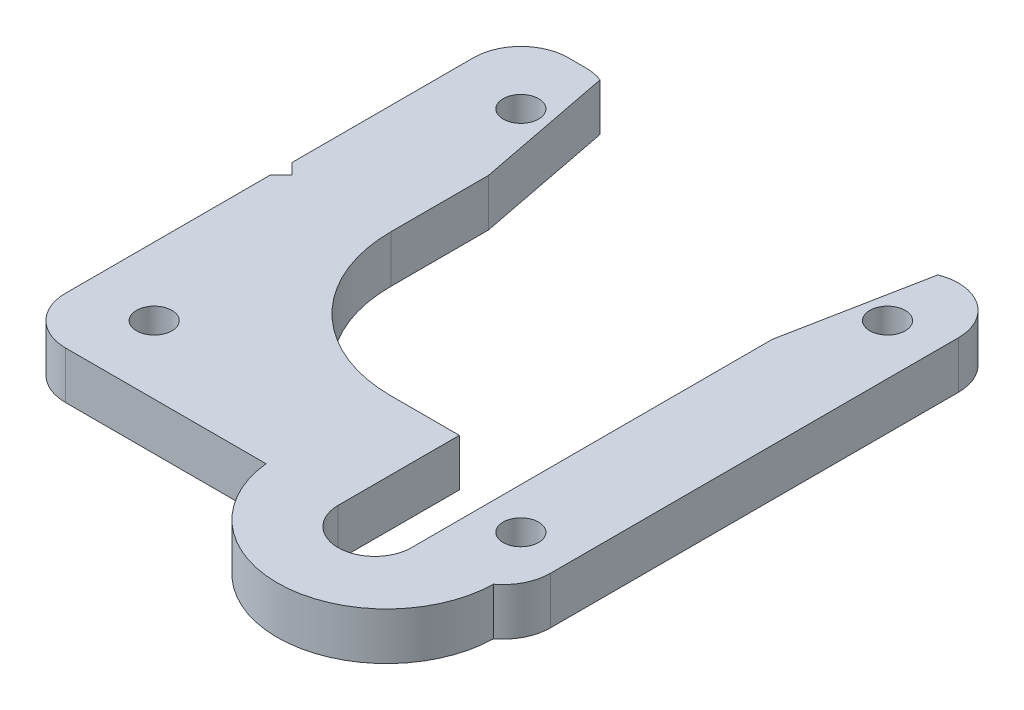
ISO-10303-21;
HEADER;
FILE_DESCRIPTION(('STEP AP214'),'2;1');
FILE_NAME('part.step','',(''),(''),'','','');
FILE_SCHEMA(('AUTOMOTIVE_DESIGN { 1 0 10303 214 1 1 1 1 }'));
ENDSEC;
DATA;
#1=APPLICATION_CONTEXT('core data for automotive mechanical design processes');
#2=APPLICATION_PROTOCOL_DEFINITION('international standard','automotive_design',2000,#1);
#3=PRODUCT_CONTEXT('',#1,'mechanical');
#4=PRODUCT('Part','Part','',(#3));
#5=PRODUCT_RELATED_PRODUCT_CATEGORY('part','',(#4));
#6=PRODUCT_DEFINITION_FORMATION('','',#4);
#7=PRODUCT_DEFINITION_CONTEXT('part definition',#1,'design');
#8=PRODUCT_DEFINITION('design','',#6,#7);
#9=PRODUCT_DEFINITION_SHAPE('','',#8);
#10=(LENGTH_UNIT() NAMED_UNIT(*) SI_UNIT(.MILLI.,.METRE.));
#11=(NAMED_UNIT(*) PLANE_ANGLE_UNIT() SI_UNIT($,.RADIAN.));
#12=(NAMED_UNIT(*) SI_UNIT($,.STERADIAN.) SOLID_ANGLE_UNIT());
#13=UNCERTAINTY_MEASURE_WITH_UNIT(LENGTH_MEASURE(1.E-05),#10,'distance_accuracy_value','');
#14=(GEOMETRIC_REPRESENTATION_CONTEXT(3) GLOBAL_UNCERTAINTY_ASSIGNED_CONTEXT((#13)) GLOBAL_UNIT_ASSIGNED_CONTEXT((#10,
#11,#12)) REPRESENTATION_CONTEXT('',''));
#15=CARTESIAN_POINT('',(0.,0.,0.));
#16=DIRECTION('',(0.,0.,1.));
#17=DIRECTION('',(1.,0.,0.));
#18=AXIS2_PLACEMENT_3D('',#15,#16,#17);
#19=CARTESIAN_POINT('',(-15.75,-2.,-20.25));
#20=DIRECTION('',(0.,0.,-1.));
#21=DIRECTION('',(-1.,0.,0.));
#22=AXIS2_PLACEMENT_3D('',#19,#20,#21);
#23=PLANE('',#22);
#24=DIRECTION('',(0.,1.,0.));
#25=VECTOR('',#24,1.);
#26=CARTESIAN_POINT('',(-15.75,-2.,-20.25));
#27=LINE('',#26,#25);
#28=CARTESIAN_POINT('',(-15.75,-2.,-20.25));
#29=VERTEX_POINT('',#28);
#30=CARTESIAN_POINT('',(-15.75,2.,-20.25));
#31=VERTEX_POINT('',#30);
#32=EDGE_CURVE('E309',#29,#31,#27,.T.);
#33=ORIENTED_EDGE('',*,*,#32,.F.);
#34=DIRECTION('',(-1.,0.,0.));
#35=VECTOR('',#34,1.);
#36=CARTESIAN_POINT('',(-15.75,-2.,-20.25));
#37=LINE('',#36,#35);
#38=CARTESIAN_POINT('',(-17.25,-2.,-20.25));
#39=VERTEX_POINT('',#38);
#40=EDGE_CURVE('E326',#29,#39,#37,.T.);
#41=ORIENTED_EDGE('',*,*,#40,.T.);
#42=DIRECTION('',(0.,1.,0.));
#43=VECTOR('',#42,1.);
#44=CARTESIAN_POINT('',(-17.25,-2.,-20.25));
#45=LINE('',#44,#43);
#46=CARTESIAN_POINT('',(-17.25,2.,-20.25));
#47=VERTEX_POINT('',#46);
#48=EDGE_CURVE('E270',#47,#39,#45,.F.);
#49=ORIENTED_EDGE('',*,*,#48,.F.);
#50=DIRECTION('',(1.,0.,0.));
#51=VECTOR('',#50,1.);
#52=CARTESIAN_POINT('',(0.,2.,-20.25));
#53=LINE('',#52,#51);
#54=EDGE_CURVE('E276',#31,#47,#53,.F.);
#55=ORIENTED_EDGE('',*,*,#54,.F.);
#56=EDGE_LOOP('',(#33,#41,#49,#55));
#57=FACE_BOUND('',#56,.T.);
#58=ADVANCED_FACE('F17',(#57),#23,.T.);
#59=CARTESIAN_POINT('',(-21.25,-2.,-0.9));
#60=DIRECTION('',(-0.707106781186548,0.,0.707106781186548));
#61=DIRECTION('',(0.707106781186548,0.,0.707106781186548));
#62=AXIS2_PLACEMENT_3D('',#59,#60,#61);
#63=PLANE('',#62);
#64=DIRECTION('',(0.,1.,0.));
#65=VECTOR('',#64,1.);
#66=CARTESIAN_POINT('',(-21.25,-2.,-0.9));
#67=LINE('',#66,#65);
#68=CARTESIAN_POINT('',(-21.25,-2.,-0.9));
#69=VERTEX_POINT('',#68);
#70=CARTESIAN_POINT('',(-21.25,2.,-0.9));
#71=VERTEX_POINT('',#70);
#72=EDGE_CURVE('E268',#69,#71,#67,.T.);
#73=ORIENTED_EDGE('',*,*,#72,.F.);
#74=DIRECTION('',(0.707106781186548,0.,0.707106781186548));
#75=VECTOR('',#74,1.);
#76=CARTESIAN_POINT('',(-21.25,-2.,-0.9));
#77=LINE('',#76,#75);
#78=CARTESIAN_POINT('',(-20.35,-2.,0.));
#79=VERTEX_POINT('',#78);
#80=EDGE_CURVE('E324',#69,#79,#77,.T.);
#81=ORIENTED_EDGE('',*,*,#80,.T.);
#82=DIRECTION('',(0.,1.,0.));
#83=VECTOR('',#82,1.);
#84=CARTESIAN_POINT('',(-20.35,-2.,0.));
#85=LINE('',#84,#83);
#86=CARTESIAN_POINT('',(-20.35,2.,0.));
#87=VERTEX_POINT('',#86);
#88=EDGE_CURVE('E310',#87,#79,#85,.F.);
#89=ORIENTED_EDGE('',*,*,#88,.F.);
#90=DIRECTION('',(0.707106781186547,0.,0.707106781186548));
#91=VECTOR('',#90,1.);
#92=CARTESIAN_POINT('',(-21.25,2.,-0.9));
#93=LINE('',#92,#91);
#94=EDGE_CURVE('E315',#71,#87,#93,.T.);
#95=ORIENTED_EDGE('',*,*,#94,.F.);
#96=EDGE_LOOP('',(#73,#81,#89,#95));
#97=FACE_BOUND('',#96,.T.);
#98=ADVANCED_FACE('F523',(#97),#63,.T.);
#99=CARTESIAN_POINT('',(-20.35,-2.,0.));
#100=DIRECTION('',(-0.707106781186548,0.,-0.707106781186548));
#101=DIRECTION('',(-0.707106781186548,0.,0.707106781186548));
#102=AXIS2_PLACEMENT_3D('',#99,#100,#101);
#103=PLANE('',#102);
#104=ORIENTED_EDGE('',*,*,#88,.T.);
#105=DIRECTION('',(-0.707106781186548,0.,0.707106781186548));
#106=VECTOR('',#105,1.);
#107=CARTESIAN_POINT('',(-20.35,-2.,0.));
#108=LINE('',#107,#106);
#109=CARTESIAN_POINT('',(-21.25,-2.,0.9));
#110=VERTEX_POINT('',#109);
#111=EDGE_CURVE('E307',#79,#110,#108,.T.);
#112=ORIENTED_EDGE('',*,*,#111,.T.);
#113=DIRECTION('',(0.,1.,0.));
#114=VECTOR('',#113,1.);
#115=CARTESIAN_POINT('',(-21.25,-2.,0.9));
#116=LINE('',#115,#114);
#117=CARTESIAN_POINT('',(-21.25,2.,0.9));
#118=VERTEX_POINT('',#117);
#119=EDGE_CURVE('E259',#118,#110,#116,.F.);
#120=ORIENTED_EDGE('',*,*,#119,.F.);
#121=DIRECTION('',(-0.707106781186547,0.,0.707106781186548));
#122=VECTOR('',#121,1.);
#123=CARTESIAN_POINT('',(-20.35,2.,0.));
#124=LINE('',#123,#122);
#125=EDGE_CURVE('E313',#87,#118,#124,.T.);
#126=ORIENTED_EDGE('',*,*,#125,.F.);
#127=EDGE_LOOP('',(#104,#112,#120,#126));
#128=FACE_BOUND('',#127,.T.);
#129=ADVANCED_FACE('F519',(#128),#103,.T.);
#130=CARTESIAN_POINT('',(-15.75,-2.,-16.25));
#131=DIRECTION('',(0.,1.,0.));
#132=DIRECTION('',(0.,0.,1.));
#133=AXIS2_PLACEMENT_3D('',#130,#131,#132);
#134=CYLINDRICAL_SURFACE('',#133,4.);
#135=DIRECTION('',(0.,1.,0.));
#136=VECTOR('',#135,1.);
#137=CARTESIAN_POINT('',(-14.2780019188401,-2.,-19.96930391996));
#138=LINE('',#137,#136);
#139=CARTESIAN_POINT('',(-14.2780019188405,-2.,-19.9693039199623));
#140=VERTEX_POINT('',#139);
#141=CARTESIAN_POINT('',(-14.2780019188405,2.,-19.9693039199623));
#142=VERTEX_POINT('',#141);
#143=EDGE_CURVE('E180',#140,#142,#138,.T.);
#144=ORIENTED_EDGE('',*,*,#143,.F.);
#145=CARTESIAN_POINT('',(-15.75,-2.,-16.25));
#146=DIRECTION('',(0.,1.,0.));
#147=DIRECTION('',(0.,0.,1.));
#148=AXIS2_PLACEMENT_3D('',#145,#146,#147);
#149=CIRCLE('',#148,4.);
#150=EDGE_CURVE('E20',#140,#29,#149,.T.);
#151=ORIENTED_EDGE('',*,*,#150,.T.);
#152=ORIENTED_EDGE('',*,*,#32,.T.);
#153=CARTESIAN_POINT('',(-15.75,2.,-16.25));
#154=DIRECTION('',(0.,1.,0.));
#155=DIRECTION('',(0.,0.,1.));
#156=AXIS2_PLACEMENT_3D('',#153,#154,#155);
#157=CIRCLE('',#156,4.);
#158=EDGE_CURVE('E277',#142,#31,#157,.T.);
#159=ORIENTED_EDGE('',*,*,#158,.F.);
#160=EDGE_LOOP('',(#144,#151,#152,#159));
#161=FACE_BOUND('',#160,.T.);
#162=ADVANCED_FACE('F673',(#161),#134,.T.);
#163=CARTESIAN_POINT('',(0.,2.,0.));
#164=DIRECTION('',(0.,1.,0.));
#165=DIRECTION('',(0.,0.,1.));
#166=AXIS2_PLACEMENT_3D('',#163,#164,#165);
#167=PLANE('',#166);
#168=CARTESIAN_POINT('',(-15.5,2.,-14.5));
#169=DIRECTION('',(0.,1.,0.));
#170=DIRECTION('',(0.,0.,1.));
#171=AXIS2_PLACEMENT_3D('',#168,#169,#170);
#172=CIRCLE('',#171,1.5);
#173=CARTESIAN_POINT('',(-15.5,2.,-13.));
#174=VERTEX_POINT('',#173);
#175=EDGE_CURVE('E380',#174,#174,#172,.F.);
#176=ORIENTED_EDGE('',*,*,#175,.T.);
#177=EDGE_LOOP('',(#176));
#178=FACE_BOUND('',#177,.T.);
#179=CARTESIAN_POINT('',(-15.5,2.,16.5));
#180=DIRECTION('',(0.,1.,0.));
#181=DIRECTION('',(0.,0.,1.));
#182=AXIS2_PLACEMENT_3D('',#179,#180,#181);
#183=CIRCLE('',#182,1.5);
#184=CARTESIAN_POINT('',(-15.5,2.,18.));
#185=VERTEX_POINT('',#184);
#186=EDGE_CURVE('E383',#185,#185,#183,.F.);
#187=ORIENTED_EDGE('',*,*,#186,.T.);
#188=EDGE_LOOP('',(#187));
#189=FACE_BOUND('',#188,.T.);
#190=CARTESIAN_POINT('',(15.5,2.,16.5));
#191=DIRECTION('',(0.,1.,0.));
#192=DIRECTION('',(0.,0.,1.));
#193=AXIS2_PLACEMENT_3D('',#190,#191,#192);
#194=CIRCLE('',#193,1.5);
#195=CARTESIAN_POINT('',(15.5,2.,18.));
#196=VERTEX_POINT('',#195);
#197=EDGE_CURVE('E201',#196,#196,#194,.F.);
#198=ORIENTED_EDGE('',*,*,#197,.T.);
#199=EDGE_LOOP('',(#198));
#200=FACE_BOUND('',#199,.T.);
#201=CARTESIAN_POINT('',(15.5,2.,-14.5));
#202=DIRECTION('',(0.,1.,0.));
#203=DIRECTION('',(0.,0.,1.));
#204=AXIS2_PLACEMENT_3D('',#201,#202,#203);
#205=CIRCLE('',#204,1.5);
#206=CARTESIAN_POINT('',(15.5,2.,-13.));
#207=VERTEX_POINT('',#206);
#208=EDGE_CURVE('E198',#207,#207,#205,.F.);
#209=ORIENTED_EDGE('',*,*,#208,.T.);
#210=EDGE_LOOP('',(#209));
#211=FACE_BOUND('',#210,.T.);
#212=ORIENTED_EDGE('',*,*,#54,.T.);
#213=CARTESIAN_POINT('',(-17.25,2.,-16.25));
#214=DIRECTION('',(0.,1.,0.));
#215=DIRECTION('',(0.,0.,1.));
#216=AXIS2_PLACEMENT_3D('',#213,#214,#215);
#217=CIRCLE('',#216,4.);
#218=CARTESIAN_POINT('',(-21.25,2.,-16.25));
#219=VERTEX_POINT('',#218);
#220=EDGE_CURVE('E275',#219,#47,#217,.F.);
#221=ORIENTED_EDGE('',*,*,#220,.F.);
#222=DIRECTION('',(0.,0.,1.));
#223=VECTOR('',#222,1.);
#224=CARTESIAN_POINT('',(-21.25,2.,-16.25));
#225=LINE('',#224,#223);
#226=EDGE_CURVE('E267',#71,#219,#225,.F.);
#227=ORIENTED_EDGE('',*,*,#226,.F.);
#228=ORIENTED_EDGE('',*,*,#94,.T.);
#229=ORIENTED_EDGE('',*,*,#125,.T.);
#230=DIRECTION('',(0.,0.,1.));
#231=VECTOR('',#230,1.);
#232=CARTESIAN_POINT('',(-21.25,2.,0.9));
#233=LINE('',#232,#231);
#234=CARTESIAN_POINT('',(-21.25,2.,18.25));
#235=VERTEX_POINT('',#234);
#236=EDGE_CURVE('E262',#235,#118,#233,.F.);
#237=ORIENTED_EDGE('',*,*,#236,.F.);
#238=CARTESIAN_POINT('',(-17.25,2.,18.25));
#239=DIRECTION('',(0.,1.,0.));
#240=DIRECTION('',(0.,0.,1.));
#241=AXIS2_PLACEMENT_3D('',#238,#239,#240);
#242=CIRCLE('',#241,4.);
#243=CARTESIAN_POINT('',(-17.25,2.,22.25));
#244=VERTEX_POINT('',#243);
#245=EDGE_CURVE('E258',#244,#235,#242,.F.);
#246=ORIENTED_EDGE('',*,*,#245,.F.);
#247=DIRECTION('',(1.,0.,0.));
#248=VECTOR('',#247,1.);
#249=CARTESIAN_POINT('',(-17.25,2.,22.25));
#250=LINE('',#249,#248);
#251=CARTESIAN_POINT('',(-0.295787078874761,2.,22.25));
#252=VERTEX_POINT('',#251);
#253=EDGE_CURVE('E254',#252,#244,#250,.F.);
#254=ORIENTED_EDGE('',*,*,#253,.F.);
#255=CARTESIAN_POINT('',(8.9,2.,21.25));
#256=DIRECTION('',(0.,1.,0.));
#257=DIRECTION('',(0.,0.,1.));
#258=AXIS2_PLACEMENT_3D('',#255,#256,#257);
#259=CIRCLE('',#258,9.25);
#260=CARTESIAN_POINT('',(18.1478018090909,2.,21.451647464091));
#261=VERTEX_POINT('',#260);
#262=EDGE_CURVE('E250',#261,#252,#259,.F.);
#263=ORIENTED_EDGE('',*,*,#262,.F.);
#264=CARTESIAN_POINT('',(15.75,2.,18.25));
#265=DIRECTION('',(0.,1.,0.));
#266=DIRECTION('',(0.,0.,1.));
#267=AXIS2_PLACEMENT_3D('',#264,#265,#266);
#268=CIRCLE('',#267,4.);
#269=CARTESIAN_POINT('',(19.75,2.,18.25));
#270=VERTEX_POINT('',#269);
#271=EDGE_CURVE('E246',#270,#261,#268,.F.);
#272=ORIENTED_EDGE('',*,*,#271,.F.);
#273=DIRECTION('',(0.,0.,-1.));
#274=VECTOR('',#273,1.);
#275=CARTESIAN_POINT('',(19.75,2.,18.25));
#276=LINE('',#275,#274);
#277=CARTESIAN_POINT('',(19.75,2.,-16.25));
#278=VERTEX_POINT('',#277);
#279=EDGE_CURVE('E242',#278,#270,#276,.F.);
#280=ORIENTED_EDGE('',*,*,#279,.F.);
#281=CARTESIAN_POINT('',(15.75,2.,-16.25));
#282=DIRECTION('',(0.,1.,0.));
#283=DIRECTION('',(0.,0.,1.));
#284=AXIS2_PLACEMENT_3D('',#281,#282,#283);
#285=CIRCLE('',#284,4.);
#286=CARTESIAN_POINT('',(14.2780019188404,2.,-19.9693039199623));
#287=VERTEX_POINT('',#286);
#288=EDGE_CURVE('E238',#287,#278,#285,.F.);
#289=ORIENTED_EDGE('',*,*,#288,.F.);
#290=DIRECTION('',(-0.190808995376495,0.,0.981627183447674));
#291=VECTOR('',#290,1.);
#292=CARTESIAN_POINT('',(14.27800191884,2.,-19.96930391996));
#293=LINE('',#292,#291);
#294=CARTESIAN_POINT('',(12.,2.,-8.25000000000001));
#295=VERTEX_POINT('',#294);
#296=EDGE_CURVE('E235',#295,#287,#293,.F.);
#297=ORIENTED_EDGE('',*,*,#296,.F.);
#298=DIRECTION('',(0.,0.,1.));
#299=VECTOR('',#298,1.);
#300=CARTESIAN_POINT('',(12.,2.,-8.25));
#301=LINE('',#300,#299);
#302=CARTESIAN_POINT('',(12.,2.,22.25));
#303=VERTEX_POINT('',#302);
#304=EDGE_CURVE('E230',#303,#295,#301,.F.);
#305=ORIENTED_EDGE('',*,*,#304,.F.);
#306=CARTESIAN_POINT('',(8.9,2.,22.25));
#307=DIRECTION('',(0.,1.,0.));
#308=DIRECTION('',(0.,0.,1.));
#309=AXIS2_PLACEMENT_3D('',#306,#307,#308);
#310=CIRCLE('',#309,3.1);
#311=CARTESIAN_POINT('',(5.8,2.,22.25));
#312=VERTEX_POINT('',#311);
#313=EDGE_CURVE('E227',#303,#312,#310,.F.);
#314=ORIENTED_EDGE('',*,*,#313,.T.);
#315=DIRECTION('',(0.,0.,-1.));
#316=VECTOR('',#315,1.);
#317=CARTESIAN_POINT('',(5.8,2.,22.25));
#318=LINE('',#317,#316);
#319=CARTESIAN_POINT('',(5.8,2.,12.));
#320=VERTEX_POINT('',#319);
#321=EDGE_CURVE('E222',#320,#312,#318,.F.);
#322=ORIENTED_EDGE('',*,*,#321,.F.);
#323=DIRECTION('',(-1.,0.,0.));
#324=VECTOR('',#323,1.);
#325=CARTESIAN_POINT('',(5.8,2.,12.));
#326=LINE('',#325,#324);
#327=CARTESIAN_POINT('',(0.,2.,12.));
#328=VERTEX_POINT('',#327);
#329=EDGE_CURVE('E216',#328,#320,#326,.F.);
#330=ORIENTED_EDGE('',*,*,#329,.F.);
#331=CARTESIAN_POINT('',(0.,2.,0.));
#332=DIRECTION('',(0.,1.,0.));
#333=DIRECTION('',(0.,0.,1.));
#334=AXIS2_PLACEMENT_3D('',#331,#332,#333);
#335=CIRCLE('',#334,12.);
#336=CARTESIAN_POINT('',(-12.,2.,0.));
#337=VERTEX_POINT('',#336);
#338=EDGE_CURVE('E189',#328,#337,#335,.F.);
#339=ORIENTED_EDGE('',*,*,#338,.T.);
#340=DIRECTION('',(0.,0.,-1.));
#341=VECTOR('',#340,1.);
#342=CARTESIAN_POINT('',(-12.,2.,0.));
#343=LINE('',#342,#341);
#344=CARTESIAN_POINT('',(-12.,2.,-8.25));
#345=VERTEX_POINT('',#344);
#346=EDGE_CURVE('E186',#345,#337,#343,.F.);
#347=ORIENTED_EDGE('',*,*,#346,.F.);
#348=DIRECTION('',(-0.190808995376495,0.,-0.981627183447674));
#349=VECTOR('',#348,1.);
#350=CARTESIAN_POINT('',(-12.,2.,-8.25));
#351=LINE('',#350,#349);
#352=EDGE_CURVE('E174',#142,#345,#351,.F.);
#353=ORIENTED_EDGE('',*,*,#352,.F.);
#354=ORIENTED_EDGE('',*,*,#158,.T.);
#355=EDGE_LOOP('',(#212,#221,#227,#228,#229,#237,#246,#254,#263,#272,#280,#289,#297,#305,#314,
#322,#330,#339,#347,#353,#354));
#356=FACE_BOUND('',#355,.T.);
#357=ADVANCED_FACE('F187',(#178,#189,#200,#211,#356),#167,.T.);
#358=CARTESIAN_POINT('',(-17.25,-2.,-16.25));
#359=DIRECTION('',(0.,1.,0.));
#360=DIRECTION('',(0.,0.,1.));
#361=AXIS2_PLACEMENT_3D('',#358,#359,#360);
#362=CYLINDRICAL_SURFACE('',#361,4.);
#363=ORIENTED_EDGE('',*,*,#48,.T.);
#364=CARTESIAN_POINT('',(-17.25,-2.,-16.25));
#365=DIRECTION('',(0.,1.,0.));
#366=DIRECTION('',(0.,0.,1.));
#367=AXIS2_PLACEMENT_3D('',#364,#365,#366);
#368=CIRCLE('',#367,4.);
#369=CARTESIAN_POINT('',(-21.25,-2.,-16.25));
#370=VERTEX_POINT('',#369);
#371=EDGE_CURVE('E376',#39,#370,#368,.T.);
#372=ORIENTED_EDGE('',*,*,#371,.T.);
#373=DIRECTION('',(0.,1.,0.));
#374=VECTOR('',#373,1.);
#375=CARTESIAN_POINT('',(-21.25,-2.,-16.25));
#376=LINE('',#375,#374);
#377=EDGE_CURVE('E265',#219,#370,#376,.F.);
#378=ORIENTED_EDGE('',*,*,#377,.F.);
#379=ORIENTED_EDGE('',*,*,#220,.T.);
#380=EDGE_LOOP('',(#363,#372,#378,#379));
#381=FACE_BOUND('',#380,.T.);
#382=ADVANCED_FACE('F411',(#381),#362,.T.);
#383=CARTESIAN_POINT('',(-21.25,-2.,-16.25));
#384=DIRECTION('',(-1.,0.,0.));
#385=DIRECTION('',(0.,0.,1.));
#386=AXIS2_PLACEMENT_3D('',#383,#384,#385);
#387=PLANE('',#386);
#388=ORIENTED_EDGE('',*,*,#377,.T.);
#389=DIRECTION('',(0.,0.,1.));
#390=VECTOR('',#389,1.);
#391=CARTESIAN_POINT('',(-21.25,-2.,0.));
#392=LINE('',#391,#390);
#393=EDGE_CURVE('E379',#370,#69,#392,.T.);
#394=ORIENTED_EDGE('',*,*,#393,.T.);
#395=ORIENTED_EDGE('',*,*,#72,.T.);
#396=ORIENTED_EDGE('',*,*,#226,.T.);
#397=EDGE_LOOP('',(#388,#394,#395,#396));
#398=FACE_BOUND('',#397,.T.);
#399=ADVANCED_FACE('F525',(#398),#387,.T.);
#400=CARTESIAN_POINT('',(-21.25,-2.,0.9));
#401=DIRECTION('',(-1.,0.,0.));
#402=DIRECTION('',(0.,0.,1.));
#403=AXIS2_PLACEMENT_3D('',#400,#401,#402);
#404=PLANE('',#403);
#405=ORIENTED_EDGE('',*,*,#119,.T.);
#406=DIRECTION('',(0.,0.,1.));
#407=VECTOR('',#406,1.);
#408=CARTESIAN_POINT('',(-21.25,-2.,0.));
#409=LINE('',#408,#407);
#410=CARTESIAN_POINT('',(-21.25,-2.,18.25));
#411=VERTEX_POINT('',#410);
#412=EDGE_CURVE('E375',#110,#411,#409,.T.);
#413=ORIENTED_EDGE('',*,*,#412,.T.);
#414=DIRECTION('',(0.,1.,0.));
#415=VECTOR('',#414,1.);
#416=CARTESIAN_POINT('',(-21.25,-2.,18.25));
#417=LINE('',#416,#415);
#418=EDGE_CURVE('E255',#235,#411,#417,.F.);
#419=ORIENTED_EDGE('',*,*,#418,.F.);
#420=ORIENTED_EDGE('',*,*,#236,.T.);
#421=EDGE_LOOP('',(#405,#413,#419,#420));
#422=FACE_BOUND('',#421,.T.);
#423=ADVANCED_FACE('F515',(#422),#404,.T.);
#424=CARTESIAN_POINT('',(-17.25,-2.,18.25));
#425=DIRECTION('',(0.,1.,0.));
#426=DIRECTION('',(0.,0.,1.));
#427=AXIS2_PLACEMENT_3D('',#424,#425,#426);
#428=CYLINDRICAL_SURFACE('',#427,4.);
#429=ORIENTED_EDGE('',*,*,#418,.T.);
#430=CARTESIAN_POINT('',(-17.25,-2.,18.25));
#431=DIRECTION('',(0.,1.,0.));
#432=DIRECTION('',(0.,0.,1.));
#433=AXIS2_PLACEMENT_3D('',#430,#431,#432);
#434=CIRCLE('',#433,4.);
#435=CARTESIAN_POINT('',(-17.25,-2.,22.25));
#436=VERTEX_POINT('',#435);
#437=EDGE_CURVE('E371',#411,#436,#434,.T.);
#438=ORIENTED_EDGE('',*,*,#437,.T.);
#439=DIRECTION('',(0.,1.,0.));
#440=VECTOR('',#439,1.);
#441=CARTESIAN_POINT('',(-17.25,-2.,22.25));
#442=LINE('',#441,#440);
#443=EDGE_CURVE('E251',#244,#436,#442,.F.);
#444=ORIENTED_EDGE('',*,*,#443,.F.);
#445=ORIENTED_EDGE('',*,*,#245,.T.);
#446=EDGE_LOOP('',(#429,#438,#444,#445));
#447=FACE_BOUND('',#446,.T.);
#448=ADVANCED_FACE('F510',(#447),#428,.T.);
#449=CARTESIAN_POINT('',(-17.25,-2.,22.25));
#450=DIRECTION('',(0.,0.,1.));
#451=DIRECTION('',(1.,0.,0.));
#452=AXIS2_PLACEMENT_3D('',#449,#450,#451);
#453=PLANE('',#452);
#454=ORIENTED_EDGE('',*,*,#443,.T.);
#455=DIRECTION('',(1.,0.,0.));
#456=VECTOR('',#455,1.);
#457=CARTESIAN_POINT('',(0.,-2.,22.25));
#458=LINE('',#457,#456);
#459=CARTESIAN_POINT('',(-0.295787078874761,-2.,22.25));
#460=VERTEX_POINT('',#459);
#461=EDGE_CURVE('E370',#436,#460,#458,.T.);
#462=ORIENTED_EDGE('',*,*,#461,.T.);
#463=DIRECTION('',(0.,1.,0.));
#464=VECTOR('',#463,1.);
#465=CARTESIAN_POINT('',(-0.295787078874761,-2.,22.25));
#466=LINE('',#465,#464);
#467=EDGE_CURVE('E247',#252,#460,#466,.F.);
#468=ORIENTED_EDGE('',*,*,#467,.F.);
#469=ORIENTED_EDGE('',*,*,#253,.T.);
#470=EDGE_LOOP('',(#454,#462,#468,#469));
#471=FACE_BOUND('',#470,.T.);
#472=ADVANCED_FACE('F506',(#471),#453,.T.);
#473=CARTESIAN_POINT('',(8.9,-2.,21.25));
#474=DIRECTION('',(0.,1.,0.));
#475=DIRECTION('',(0.,0.,1.));
#476=AXIS2_PLACEMENT_3D('',#473,#474,#475);
#477=CYLINDRICAL_SURFACE('',#476,9.25);
#478=ORIENTED_EDGE('',*,*,#467,.T.);
#479=CARTESIAN_POINT('',(8.9,-2.,21.25));
#480=DIRECTION('',(0.,1.,0.));
#481=DIRECTION('',(0.,0.,1.));
#482=AXIS2_PLACEMENT_3D('',#479,#480,#481);
#483=CIRCLE('',#482,9.25);
#484=CARTESIAN_POINT('',(18.1478018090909,-2.,21.451647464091));
#485=VERTEX_POINT('',#484);
#486=EDGE_CURVE('E366',#460,#485,#483,.T.);
#487=ORIENTED_EDGE('',*,*,#486,.T.);
#488=DIRECTION('',(0.,1.,0.));
#489=VECTOR('',#488,1.);
#490=CARTESIAN_POINT('',(18.1478018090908,-2.,21.4516474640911));
#491=LINE('',#490,#489);
#492=EDGE_CURVE('E243',#261,#485,#491,.F.);
#493=ORIENTED_EDGE('',*,*,#492,.F.);
#494=ORIENTED_EDGE('',*,*,#262,.T.);
#495=EDGE_LOOP('',(#478,#487,#493,#494));
#496=FACE_BOUND('',#495,.T.);
#497=ADVANCED_FACE('F500',(#496),#477,.T.);
#498=CARTESIAN_POINT('',(15.75,-2.,18.25));
#499=DIRECTION('',(0.,1.,0.));
#500=DIRECTION('',(0.,0.,1.));
#501=AXIS2_PLACEMENT_3D('',#498,#499,#500);
#502=CYLINDRICAL_SURFACE('',#501,4.);
#503=ORIENTED_EDGE('',*,*,#492,.T.);
#504=CARTESIAN_POINT('',(15.75,-2.,18.25));
#505=DIRECTION('',(0.,1.,0.));
#506=DIRECTION('',(0.,0.,1.));
#507=AXIS2_PLACEMENT_3D('',#504,#505,#506);
#508=CIRCLE('',#507,4.);
#509=CARTESIAN_POINT('',(19.75,-2.,18.25));
#510=VERTEX_POINT('',#509);
#511=EDGE_CURVE('E362',#485,#510,#508,.T.);
#512=ORIENTED_EDGE('',*,*,#511,.T.);
#513=DIRECTION('',(0.,1.,0.));
#514=VECTOR('',#513,1.);
#515=CARTESIAN_POINT('',(19.75,-2.,18.25));
#516=LINE('',#515,#514);
#517=EDGE_CURVE('E239',#270,#510,#516,.F.);
#518=ORIENTED_EDGE('',*,*,#517,.F.);
#519=ORIENTED_EDGE('',*,*,#271,.T.);
#520=EDGE_LOOP('',(#503,#512,#518,#519));
#521=FACE_BOUND('',#520,.T.);
#522=ADVANCED_FACE('F496',(#521),#502,.T.);
#523=CARTESIAN_POINT('',(19.75,-2.,18.25));
#524=DIRECTION('',(1.,0.,0.));
#525=DIRECTION('',(0.,0.,-1.));
#526=AXIS2_PLACEMENT_3D('',#523,#524,#525);
#527=PLANE('',#526);
#528=ORIENTED_EDGE('',*,*,#517,.T.);
#529=DIRECTION('',(0.,0.,1.));
#530=VECTOR('',#529,1.);
#531=CARTESIAN_POINT('',(19.75,-2.,0.));
#532=LINE('',#531,#530);
#533=CARTESIAN_POINT('',(19.75,-2.,-16.25));
#534=VERTEX_POINT('',#533);
#535=EDGE_CURVE('E361',#510,#534,#532,.F.);
#536=ORIENTED_EDGE('',*,*,#535,.T.);
#537=DIRECTION('',(0.,1.,0.));
#538=VECTOR('',#537,1.);
#539=CARTESIAN_POINT('',(19.75,-2.,-16.25));
#540=LINE('',#539,#538);
#541=EDGE_CURVE('E236',#278,#534,#540,.F.);
#542=ORIENTED_EDGE('',*,*,#541,.F.);
#543=ORIENTED_EDGE('',*,*,#279,.T.);
#544=EDGE_LOOP('',(#528,#536,#542,#543));
#545=FACE_BOUND('',#544,.T.);
#546=ADVANCED_FACE('F490',(#545),#527,.T.);
#547=CARTESIAN_POINT('',(15.75,-2.,-16.25));
#548=DIRECTION('',(0.,1.,0.));
#549=DIRECTION('',(0.,0.,1.));
#550=AXIS2_PLACEMENT_3D('',#547,#548,#549);
#551=CYLINDRICAL_SURFACE('',#550,4.);
#552=ORIENTED_EDGE('',*,*,#541,.T.);
#553=CARTESIAN_POINT('',(15.75,-2.,-16.25));
#554=DIRECTION('',(0.,1.,0.));
#555=DIRECTION('',(0.,0.,1.));
#556=AXIS2_PLACEMENT_3D('',#553,#554,#555);
#557=CIRCLE('',#556,4.);
#558=CARTESIAN_POINT('',(14.2780019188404,-2.,-19.9693039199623));
#559=VERTEX_POINT('',#558);
#560=EDGE_CURVE('E357',#534,#559,#557,.T.);
#561=ORIENTED_EDGE('',*,*,#560,.T.);
#562=DIRECTION('',(0.,1.,0.));
#563=VECTOR('',#562,1.);
#564=CARTESIAN_POINT('',(14.27800191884,-2.,-19.96930391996));
#565=LINE('',#564,#563);
#566=EDGE_CURVE('E233',#287,#559,#565,.F.);
#567=ORIENTED_EDGE('',*,*,#566,.F.);
#568=ORIENTED_EDGE('',*,*,#288,.T.);
#569=EDGE_LOOP('',(#552,#561,#567,#568));
#570=FACE_BOUND('',#569,.T.);
#571=ADVANCED_FACE('F486',(#570),#551,.T.);
#572=CARTESIAN_POINT('',(14.27800191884,-2.,-19.96930391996));
#573=DIRECTION('',(-0.981627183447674,0.,-0.190808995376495));
#574=DIRECTION('',(-0.190808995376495,0.,0.981627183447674));
#575=AXIS2_PLACEMENT_3D('',#572,#573,#574);
#576=PLANE('',#575);
#577=ORIENTED_EDGE('',*,*,#566,.T.);
#578=DIRECTION('',(-0.190808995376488,0.,0.981627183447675));
#579=VECTOR('',#578,1.);
#580=CARTESIAN_POINT('',(14.27800191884,-2.,-19.96930391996));
#581=LINE('',#580,#579);
#582=CARTESIAN_POINT('',(12.,-2.,-8.25000000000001));
#583=VERTEX_POINT('',#582);
#584=EDGE_CURVE('E360',#559,#583,#581,.T.);
#585=ORIENTED_EDGE('',*,*,#584,.T.);
#586=DIRECTION('',(0.,1.,0.));
#587=VECTOR('',#586,1.);
#588=CARTESIAN_POINT('',(12.,-2.,-8.25));
#589=LINE('',#588,#587);
#590=EDGE_CURVE('E228',#295,#583,#589,.F.);
#591=ORIENTED_EDGE('',*,*,#590,.F.);
#592=ORIENTED_EDGE('',*,*,#296,.T.);
#593=EDGE_LOOP('',(#577,#585,#591,#592));
#594=FACE_BOUND('',#593,.T.);
#595=ADVANCED_FACE('F480',(#594),#576,.T.);
#596=CARTESIAN_POINT('',(12.,-2.,-8.25));
#597=DIRECTION('',(-1.,0.,0.));
#598=DIRECTION('',(0.,0.,1.));
#599=AXIS2_PLACEMENT_3D('',#596,#597,#598);
#600=PLANE('',#599);
#601=ORIENTED_EDGE('',*,*,#590,.T.);
#602=DIRECTION('',(0.,0.,1.));
#603=VECTOR('',#602,1.);
#604=CARTESIAN_POINT('',(12.,-2.,0.));
#605=LINE('',#604,#603);
#606=CARTESIAN_POINT('',(12.,-2.,22.25));
#607=VERTEX_POINT('',#606);
#608=EDGE_CURVE('E356',#583,#607,#605,.T.);
#609=ORIENTED_EDGE('',*,*,#608,.T.);
#610=DIRECTION('',(0.,1.,0.));
#611=VECTOR('',#610,1.);
#612=CARTESIAN_POINT('',(12.,-2.,22.25));
#613=LINE('',#612,#611);
#614=EDGE_CURVE('E223',#607,#303,#613,.T.);
#615=ORIENTED_EDGE('',*,*,#614,.T.);
#616=ORIENTED_EDGE('',*,*,#304,.T.);
#617=EDGE_LOOP('',(#601,#609,#615,#616));
#618=FACE_BOUND('',#617,.T.);
#619=ADVANCED_FACE('F476',(#618),#600,.T.);
#620=CARTESIAN_POINT('',(8.9,-2.,22.25));
#621=DIRECTION('',(0.,1.,0.));
#622=DIRECTION('',(0.,0.,1.));
#623=AXIS2_PLACEMENT_3D('',#620,#621,#622);
#624=CYLINDRICAL_SURFACE('',#623,3.1);
#625=ORIENTED_EDGE('',*,*,#313,.F.);
#626=ORIENTED_EDGE('',*,*,#614,.F.);
#627=CARTESIAN_POINT('',(8.9,-2.,22.25));
#628=DIRECTION('',(0.,1.,0.));
#629=DIRECTION('',(0.,0.,1.));
#630=AXIS2_PLACEMENT_3D('',#627,#628,#629);
#631=CIRCLE('',#630,3.1);
#632=CARTESIAN_POINT('',(5.8,-2.,22.25));
#633=VERTEX_POINT('',#632);
#634=EDGE_CURVE('E351',#607,#633,#631,.F.);
#635=ORIENTED_EDGE('',*,*,#634,.T.);
#636=DIRECTION('',(0.,1.,0.));
#637=VECTOR('',#636,1.);
#638=CARTESIAN_POINT('',(5.8,-2.,22.25));
#639=LINE('',#638,#637);
#640=EDGE_CURVE('E219',#312,#633,#639,.F.);
#641=ORIENTED_EDGE('',*,*,#640,.F.);
#642=EDGE_LOOP('',(#625,#626,#635,#641));
#643=FACE_BOUND('',#642,.T.);
#644=ADVANCED_FACE('F472',(#643),#624,.F.);
#645=CARTESIAN_POINT('',(5.8,-2.,22.25));
#646=DIRECTION('',(1.,0.,0.));
#647=DIRECTION('',(0.,0.,-1.));
#648=AXIS2_PLACEMENT_3D('',#645,#646,#647);
#649=PLANE('',#648);
#650=ORIENTED_EDGE('',*,*,#640,.T.);
#651=DIRECTION('',(0.,0.,1.));
#652=VECTOR('',#651,1.);
#653=CARTESIAN_POINT('',(5.8,-2.,0.));
#654=LINE('',#653,#652);
#655=CARTESIAN_POINT('',(5.8,-2.,12.));
#656=VERTEX_POINT('',#655);
#657=EDGE_CURVE('E355',#633,#656,#654,.F.);
#658=ORIENTED_EDGE('',*,*,#657,.T.);
#659=DIRECTION('',(0.,1.,0.));
#660=VECTOR('',#659,1.);
#661=CARTESIAN_POINT('',(5.8,-2.,12.));
#662=LINE('',#661,#660);
#663=EDGE_CURVE('E213',#320,#656,#662,.F.);
#664=ORIENTED_EDGE('',*,*,#663,.F.);
#665=ORIENTED_EDGE('',*,*,#321,.T.);
#666=EDGE_LOOP('',(#650,#658,#664,#665));
#667=FACE_BOUND('',#666,.T.);
#668=ADVANCED_FACE('F468',(#667),#649,.T.);
#669=CARTESIAN_POINT('',(5.8,-2.,12.));
#670=DIRECTION('',(0.,0.,-1.));
#671=DIRECTION('',(-1.,0.,0.));
#672=AXIS2_PLACEMENT_3D('',#669,#670,#671);
#673=PLANE('',#672);
#674=ORIENTED_EDGE('',*,*,#663,.T.);
#675=DIRECTION('',(1.,0.,0.));
#676=VECTOR('',#675,1.);
#677=CARTESIAN_POINT('',(0.,-2.,12.));
#678=LINE('',#677,#676);
#679=CARTESIAN_POINT('',(0.,-2.,12.));
#680=VERTEX_POINT('',#679);
#681=EDGE_CURVE('E350',#656,#680,#678,.F.);
#682=ORIENTED_EDGE('',*,*,#681,.T.);
#683=DIRECTION('',(0.,1.,0.));
#684=VECTOR('',#683,1.);
#685=CARTESIAN_POINT('',(0.,-2.,12.));
#686=LINE('',#685,#684);
#687=EDGE_CURVE('E209',#680,#328,#686,.T.);
#688=ORIENTED_EDGE('',*,*,#687,.T.);
#689=ORIENTED_EDGE('',*,*,#329,.T.);
#690=EDGE_LOOP('',(#674,#682,#688,#689));
#691=FACE_BOUND('',#690,.T.);
#692=ADVANCED_FACE('F462',(#691),#673,.T.);
#693=CARTESIAN_POINT('',(0.,-2.,0.));
#694=DIRECTION('',(0.,1.,0.));
#695=DIRECTION('',(0.,0.,1.));
#696=AXIS2_PLACEMENT_3D('',#693,#694,#695);
#697=CYLINDRICAL_SURFACE('',#696,12.);
#698=ORIENTED_EDGE('',*,*,#338,.F.);
#699=ORIENTED_EDGE('',*,*,#687,.F.);
#700=CARTESIAN_POINT('',(0.,-2.,0.));
#701=DIRECTION('',(0.,1.,0.));
#702=DIRECTION('',(0.,0.,1.));
#703=AXIS2_PLACEMENT_3D('',#700,#701,#702);
#704=CIRCLE('',#703,12.);
#705=CARTESIAN_POINT('',(-12.,-2.,0.));
#706=VERTEX_POINT('',#705);
#707=EDGE_CURVE('E346',#680,#706,#704,.F.);
#708=ORIENTED_EDGE('',*,*,#707,.T.);
#709=DIRECTION('',(0.,1.,0.));
#710=VECTOR('',#709,1.);
#711=CARTESIAN_POINT('',(-12.,-2.,0.));
#712=LINE('',#711,#710);
#713=EDGE_CURVE('E192',#337,#706,#712,.F.);
#714=ORIENTED_EDGE('',*,*,#713,.F.);
#715=EDGE_LOOP('',(#698,#699,#708,#714));
#716=FACE_BOUND('',#715,.T.);
#717=ADVANCED_FACE('F460',(#716),#697,.F.);
#718=CARTESIAN_POINT('',(-12.,-2.,0.));
#719=DIRECTION('',(1.,0.,0.));
#720=DIRECTION('',(0.,0.,-1.));
#721=AXIS2_PLACEMENT_3D('',#718,#719,#720);
#722=PLANE('',#721);
#723=ORIENTED_EDGE('',*,*,#713,.T.);
#724=DIRECTION('',(0.,0.,1.));
#725=VECTOR('',#724,1.);
#726=CARTESIAN_POINT('',(-12.,-2.,0.));
#727=LINE('',#726,#725);
#728=CARTESIAN_POINT('',(-12.,-2.,-8.24999999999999));
#729=VERTEX_POINT('',#728);
#730=EDGE_CURVE('E197',#706,#729,#727,.F.);
#731=ORIENTED_EDGE('',*,*,#730,.T.);
#732=DIRECTION('',(0.,1.,0.));
#733=VECTOR('',#732,1.);
#734=CARTESIAN_POINT('',(-12.,-2.,-8.25));
#735=LINE('',#734,#733);
#736=EDGE_CURVE('E179',#345,#729,#735,.F.);
#737=ORIENTED_EDGE('',*,*,#736,.F.);
#738=ORIENTED_EDGE('',*,*,#346,.T.);
#739=EDGE_LOOP('',(#723,#731,#737,#738));
#740=FACE_BOUND('',#739,.T.);
#741=ADVANCED_FACE('F195',(#740),#722,.T.);
#742=CARTESIAN_POINT('',(-12.,-2.,-8.25));
#743=DIRECTION('',(0.981627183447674,0.,-0.190808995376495));
#744=DIRECTION('',(-0.190808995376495,0.,-0.981627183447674));
#745=AXIS2_PLACEMENT_3D('',#742,#743,#744);
#746=PLANE('',#745);
#747=ORIENTED_EDGE('',*,*,#736,.T.);
#748=DIRECTION('',(-0.190808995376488,0.,-0.981627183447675));
#749=VECTOR('',#748,1.);
#750=CARTESIAN_POINT('',(-12.,-2.,-8.25));
#751=LINE('',#750,#749);
#752=EDGE_CURVE('E345',#729,#140,#751,.T.);
#753=ORIENTED_EDGE('',*,*,#752,.T.);
#754=ORIENTED_EDGE('',*,*,#143,.T.);
#755=ORIENTED_EDGE('',*,*,#352,.T.);
#756=EDGE_LOOP('',(#747,#753,#754,#755));
#757=FACE_BOUND('',#756,.T.);
#758=ADVANCED_FACE('F176',(#757),#746,.T.);
#759=CARTESIAN_POINT('',(15.5,-2.,-14.5));
#760=DIRECTION('',(0.,1.,0.));
#761=DIRECTION('',(0.,0.,1.));
#762=AXIS2_PLACEMENT_3D('',#759,#760,#761);
#763=CYLINDRICAL_SURFACE('',#762,1.5);
#764=ORIENTED_EDGE('',*,*,#208,.F.);
#765=EDGE_LOOP('',(#764));
#766=FACE_BOUND('',#765,.T.);
#767=CARTESIAN_POINT('',(15.5,-2.,-14.5));
#768=DIRECTION('',(0.,1.,0.));
#769=DIRECTION('',(0.,0.,1.));
#770=AXIS2_PLACEMENT_3D('',#767,#768,#769);
#771=CIRCLE('',#770,1.5);
#772=CARTESIAN_POINT('',(15.5,-2.,-13.));
#773=VERTEX_POINT('',#772);
#774=EDGE_CURVE('E342',#773,#773,#771,.F.);
#775=ORIENTED_EDGE('',*,*,#774,.T.);
#776=EDGE_LOOP('',(#775));
#777=FACE_BOUND('',#776,.T.);
#778=ADVANCED_FACE('F554',(#766,#777),#763,.F.);
#779=CARTESIAN_POINT('',(15.5,-2.,16.5));
#780=DIRECTION('',(0.,1.,0.));
#781=DIRECTION('',(0.,0.,1.));
#782=AXIS2_PLACEMENT_3D('',#779,#780,#781);
#783=CYLINDRICAL_SURFACE('',#782,1.5);
#784=ORIENTED_EDGE('',*,*,#197,.F.);
#785=EDGE_LOOP('',(#784));
#786=FACE_BOUND('',#785,.T.);
#787=CARTESIAN_POINT('',(15.5,-2.,16.5));
#788=DIRECTION('',(0.,1.,0.));
#789=DIRECTION('',(0.,0.,1.));
#790=AXIS2_PLACEMENT_3D('',#787,#788,#789);
#791=CIRCLE('',#790,1.5);
#792=CARTESIAN_POINT('',(15.5,-2.,18.));
#793=VERTEX_POINT('',#792);
#794=EDGE_CURVE('E338',#793,#793,#791,.F.);
#795=ORIENTED_EDGE('',*,*,#794,.T.);
#796=EDGE_LOOP('',(#795));
#797=FACE_BOUND('',#796,.T.);
#798=ADVANCED_FACE('F550',(#786,#797),#783,.F.);
#799=CARTESIAN_POINT('',(-15.5,-2.,16.5));
#800=DIRECTION('',(0.,1.,0.));
#801=DIRECTION('',(0.,0.,1.));
#802=AXIS2_PLACEMENT_3D('',#799,#800,#801);
#803=CYLINDRICAL_SURFACE('',#802,1.5);
#804=ORIENTED_EDGE('',*,*,#186,.F.);
#805=EDGE_LOOP('',(#804));
#806=FACE_BOUND('',#805,.T.);
#807=CARTESIAN_POINT('',(-15.5,-2.,16.5));
#808=DIRECTION('',(0.,1.,0.));
#809=DIRECTION('',(0.,0.,1.));
#810=AXIS2_PLACEMENT_3D('',#807,#808,#809);
#811=CIRCLE('',#810,1.5);
#812=CARTESIAN_POINT('',(-15.5,-2.,18.));
#813=VERTEX_POINT('',#812);
#814=EDGE_CURVE('E26',#813,#813,#811,.F.);
#815=ORIENTED_EDGE('',*,*,#814,.T.);
#816=EDGE_LOOP('',(#815));
#817=FACE_BOUND('',#816,.T.);
#818=ADVANCED_FACE('F542',(#806,#817),#803,.F.);
#819=CARTESIAN_POINT('',(-15.5,-2.,-14.5));
#820=DIRECTION('',(0.,1.,0.));
#821=DIRECTION('',(0.,0.,1.));
#822=AXIS2_PLACEMENT_3D('',#819,#820,#821);
#823=CYLINDRICAL_SURFACE('',#822,1.5);
#824=ORIENTED_EDGE('',*,*,#175,.F.);
#825=EDGE_LOOP('',(#824));
#826=FACE_BOUND('',#825,.T.);
#827=CARTESIAN_POINT('',(-15.5,-2.,-14.5));
#828=DIRECTION('',(0.,1.,0.));
#829=DIRECTION('',(0.,0.,1.));
#830=AXIS2_PLACEMENT_3D('',#827,#828,#829);
#831=CIRCLE('',#830,1.5);
#832=CARTESIAN_POINT('',(-15.5,-2.,-13.));
#833=VERTEX_POINT('',#832);
#834=EDGE_CURVE('E11',#833,#833,#831,.F.);
#835=ORIENTED_EDGE('',*,*,#834,.T.);
#836=EDGE_LOOP('',(#835));
#837=FACE_BOUND('',#836,.T.);
#838=ADVANCED_FACE('F536',(#826,#837),#823,.F.);
#839=CARTESIAN_POINT('',(0.,-2.,0.));
#840=DIRECTION('',(0.,1.,0.));
#841=DIRECTION('',(0.,0.,1.));
#842=AXIS2_PLACEMENT_3D('',#839,#840,#841);
#843=PLANE('',#842);
#844=ORIENTED_EDGE('',*,*,#834,.F.);
#845=EDGE_LOOP('',(#844));
#846=FACE_BOUND('',#845,.T.);
#847=ORIENTED_EDGE('',*,*,#814,.F.);
#848=EDGE_LOOP('',(#847));
#849=FACE_BOUND('',#848,.T.);
#850=ORIENTED_EDGE('',*,*,#794,.F.);
#851=EDGE_LOOP('',(#850));
#852=FACE_BOUND('',#851,.T.);
#853=ORIENTED_EDGE('',*,*,#774,.F.);
#854=EDGE_LOOP('',(#853));
#855=FACE_BOUND('',#854,.T.);
#856=ORIENTED_EDGE('',*,*,#150,.F.);
#857=ORIENTED_EDGE('',*,*,#752,.F.);
#858=ORIENTED_EDGE('',*,*,#730,.F.);
#859=ORIENTED_EDGE('',*,*,#707,.F.);
#860=ORIENTED_EDGE('',*,*,#681,.F.);
#861=ORIENTED_EDGE('',*,*,#657,.F.);
#862=ORIENTED_EDGE('',*,*,#634,.F.);
#863=ORIENTED_EDGE('',*,*,#608,.F.);
#864=ORIENTED_EDGE('',*,*,#584,.F.);
#865=ORIENTED_EDGE('',*,*,#560,.F.);
#866=ORIENTED_EDGE('',*,*,#535,.F.);
#867=ORIENTED_EDGE('',*,*,#511,.F.);
#868=ORIENTED_EDGE('',*,*,#486,.F.);
#869=ORIENTED_EDGE('',*,*,#461,.F.);
#870=ORIENTED_EDGE('',*,*,#437,.F.);
#871=ORIENTED_EDGE('',*,*,#412,.F.);
#872=ORIENTED_EDGE('',*,*,#111,.F.);
#873=ORIENTED_EDGE('',*,*,#80,.F.);
#874=ORIENTED_EDGE('',*,*,#393,.F.);
#875=ORIENTED_EDGE('',*,*,#371,.F.);
#876=ORIENTED_EDGE('',*,*,#40,.F.);
#877=EDGE_LOOP('',(#856,#857,#858,#859,#860,#861,#862,#863,#864,#865,#866,#867,#868,#869,#870,
#871,#872,#873,#874,#875,#876));
#878=FACE_BOUND('',#877,.T.);
#879=ADVANCED_FACE('F414',(#846,#849,#852,#855,#878),#843,.F.);
#880=CLOSED_SHELL('',(#58,#98,#129,#162,#357,#382,#399,#423,#448,#472,#497,#522,#546,#571,#595,
#619,#644,#668,#692,#717,#741,#758,#778,#798,#818,#838,#879));
#881=MANIFOLD_SOLID_BREP('B1',#880);
#882=ADVANCED_BREP_SHAPE_REPRESENTATION('',(#18,#881),#14);
#883=SHAPE_DEFINITION_REPRESENTATION(#9,#882);
ENDSEC;
END-ISO-10303-21;
